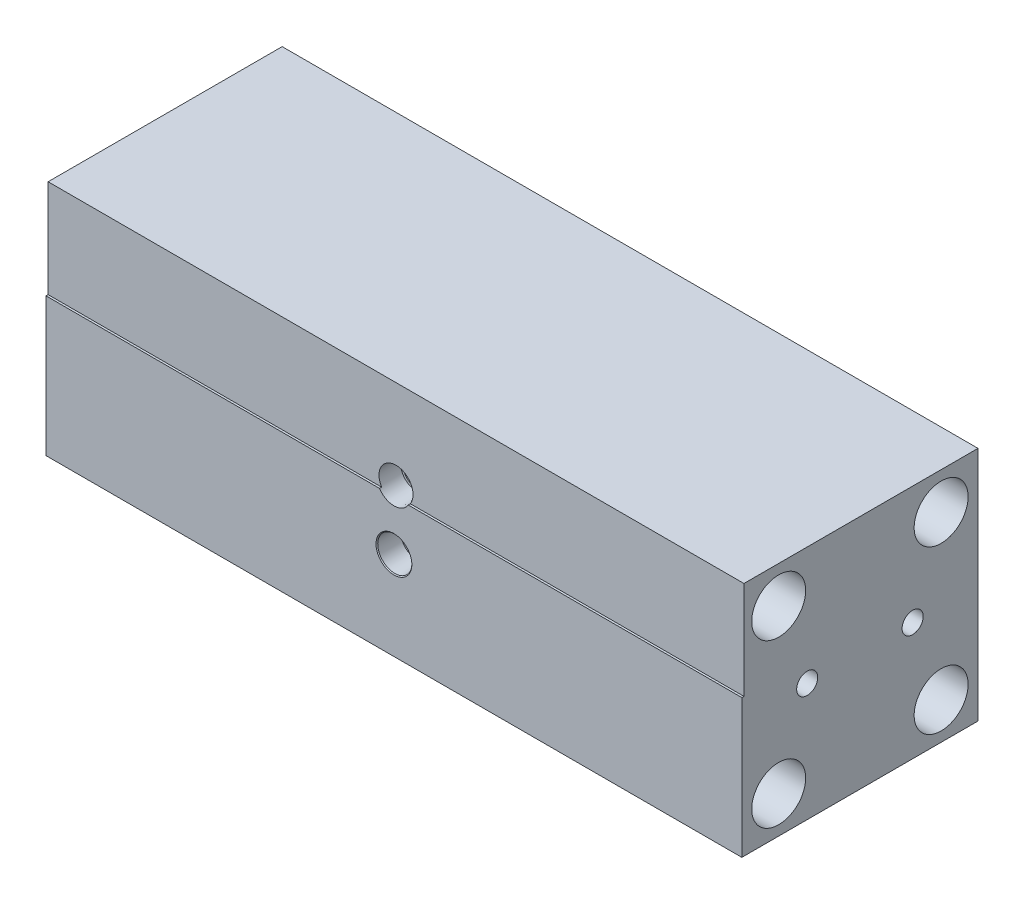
from build123d import *
from OCP.BRepFilletAPI import BRepFilletAPI_MakeChamfer

# Parameters (mm, degrees)
SKETCH1_W                         = 209.55
SKETCH1_H                         = 71.12
EXTRUDE1_DEPTH                    = 35.56
SKETCH18_W                        = 0.635
SKETCH18_H                        = 29.4386
CUT_EXTRUDE1_DEPTH                = 216.4999529
F_1_4_20_TAPPED_HOLE1_D           = 5.1054
F_1_4_20_TAPPED_HOLE1_DEPTH       = 14.3002
F_1_4_20_TAPPED_HOLE1_TIP         = 1.533816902
HOLE1_D                           = 6.35
HOLE1_DEPTH                       = 6.35
HOLE1_TIP                         = 1.907732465
F_1_8_NPT_TAPPED_HOLE1_AT_2_COUNT = 2
F_1_8_NPT_TAPPED_HOLE1_AT_2_PITCH = 17.78
F_1_4_20_TAPPED_HOLE2_D           = 5.1054
F_1_4_20_TAPPED_HOLE2_DEPTH       = 15.875
F_1_4_20_TAPPED_HOLE2_TIP         = 1.533816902
HOLE2_D                           = 6.35
HOLE2_DEPTH                       = 6.35
HOLE2_TIP                         = 1.907732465
SKETCH29_R                        = 8.128
SKETCH29_R_2                      = 3.175
CUT_EXTRUDE2_DEPTH                = 216.4999529
CHAMFER1_SIZE                     = 0.254
CHAMFER1_SIZE2                    = 0.261957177


with BuildPart() as part:
    # Sketch1 → Extrude1 (new, symmetric)
    with BuildSketch(Plane.XY):
        Rectangle(SKETCH1_W, SKETCH1_H)
    extrude(amount=EXTRUDE1_DEPTH, both=True)

    # Sketch18 → Cut-Extrude1 (cut, through all)
    with BuildSketch(Plane(origin=(104.775, 0, 0), x_dir=(0, 0, -1), z_dir=(1, 0, 0))):
        with Locations((-35.2425, 20.8407)):
            Rectangle(SKETCH18_W, SKETCH18_H)
    extrude(amount=-CUT_EXTRUDE1_DEPTH, mode=Mode.SUBTRACT)

    # 1_4-20 Tapped Hole1
    with Locations(Plane(origin=(0.538859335, -35.56, 6.981360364), x_dir=(1, 0, 0), z_dir=(0, -1, 0))):
        with Locations((-64.038859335, -6.981360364), (62.961140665, -6.981360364), (-38.638859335, -6.981360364), (37.561140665, -6.981360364), (-25.938859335, -6.981360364), (24.861140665, -6.981360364)):
            Hole(F_1_4_20_TAPPED_HOLE1_D / 2, depth=F_1_4_20_TAPPED_HOLE1_DEPTH)
            with Locations((0, 0, -(F_1_4_20_TAPPED_HOLE1_DEPTH + F_1_4_20_TAPPED_HOLE1_TIP / 2))):  # 118° drill point
                Cone(0, F_1_4_20_TAPPED_HOLE1_D / 2, F_1_4_20_TAPPED_HOLE1_TIP, mode=Mode.SUBTRACT)

    # Hole1
    with Locations(Plane(origin=(-46.133592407, -35.56, -8.969374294), x_dir=(1, 0, 0), z_dir=(0, -1, 0))):
        with Locations((-4.666407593, 8.969374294), (96.933592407, 8.969374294)):
            Hole(HOLE1_D / 2, depth=HOLE1_DEPTH)
            with Locations((0, 0, -(HOLE1_DEPTH + HOLE1_TIP / 2))):  # 118° drill point
                Cone(0, HOLE1_D / 2, HOLE1_TIP, mode=Mode.SUBTRACT)

    # Sketch23 → 1_8 NPT Tapped Hole1 (revolve, cut)
    with BuildSketch(Plane(origin=(0, -8.89, 35.56), x_dir=(0, -1, 0), z_dir=(1, 0, 0))):
        Polygon((0, 0), (0, 14.166668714), (4.2164, 11.6332), (4.2164, 6.9342), (4.936185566, 6.9342), (5.1438048, 0), align=None)
    f_1_8_npt_tapped_hole1 = revolve(axis=Axis((0, -8.89, 41.91), (0, 0, -1)), mode=Mode.SUBTRACT)

    # 1_8 NPT Tapped Hole1 at 2: 1_8 NPT Tapped Hole1 ×2
    with Locations(*[(0, i * F_1_8_NPT_TAPPED_HOLE1_AT_2_PITCH, 0) for i in range(1, F_1_8_NPT_TAPPED_HOLE1_AT_2_COUNT)]):
        add(f_1_8_npt_tapped_hole1, mode=Mode.SUBTRACT)

    # 1_4-20 Tapped Hole2
    with Locations(Plane(origin=(0, 0, -35.56), x_dir=(-1, 0, 0), z_dir=(0, 0, -1))):
        with Locations((-76.2, 10.16), (76.2, 10.16), (-76.2, -10.16), (76.2, -10.16)):
            Hole(F_1_4_20_TAPPED_HOLE2_D / 2, depth=F_1_4_20_TAPPED_HOLE2_DEPTH)
            with Locations((0, 0, -(F_1_4_20_TAPPED_HOLE2_DEPTH + F_1_4_20_TAPPED_HOLE2_TIP / 2))):  # 118° drill point
                Cone(0, F_1_4_20_TAPPED_HOLE2_D / 2, F_1_4_20_TAPPED_HOLE2_TIP, mode=Mode.SUBTRACT)

    # Hole2
    with Locations(Plane(origin=(0, 0, -35.56), x_dir=(-1, 0, 0), z_dir=(0, 0, -1))):
        with Locations((63.5, 10.16), (-63.5, -10.16)):
            Hole(HOLE2_D / 2, depth=HOLE2_DEPTH)
            with Locations((0, 0, -(HOLE2_DEPTH + HOLE2_TIP / 2))):  # 118° drill point
                Cone(0, HOLE2_D / 2, HOLE2_TIP, mode=Mode.SUBTRACT)

    # Sketch29 → Cut-Extrude2 (cut, through all)
    with BuildSketch(Plane(origin=(104.775, 0, 0), x_dir=(0, 0, -1), z_dir=(1, 0, 0))):
        with Locations((-24.4602, 24.4602)):
            Circle(SKETCH29_R)
        with Locations((24.4602, 24.4602)):
            Circle(SKETCH29_R)
        with Locations((-24.4602, -24.4602)):
            Circle(SKETCH29_R)
        with Locations((24.4602, -24.4602)):
            Circle(SKETCH29_R)
        with Locations((-15.875, 0)):
            Circle(SKETCH29_R_2)
        with Locations((15.875, 0)):
            Circle(SKETCH29_R_2)
    extrude(amount=-CUT_EXTRUDE2_DEPTH, mode=Mode.SUBTRACT)

    # Chamfer1: one chamfer whose edges measure the first distance from different faces: ONE call of the kernel's chamfer builder (chamfer() names one face for all edges)
    chamfer1_edges_1 = [part.edges().sort_by_distance(p)[0] for p in [
        (-66.675, 10.16, -35.56),
        (27.9527, -35.56, 0),
        (-22.8473, -35.56, 0),
        (40.6527, -35.56, 0),
        (-35.5473, -35.56, 0),
        (66.0527, -35.56, 0),
        (-60.9473, -35.56, 0),
        (53.975, -35.56, 0),
        (-47.625, -35.56, 0),
        (-78.7527, -10.16, -35.56),
        (73.6473, -10.16, -35.56),
        (-78.7527, 10.16, -35.56),
        (73.6473, 10.16, -35.56),
        (60.325, -10.16, -35.56),
    ]]
    chamfer1_edges_2 = [part.edges().sort_by_distance(p)[0] for p in [
        (0, -3.7461952, 35.56),
    ]]
    chamfer1_side_2 = [part.faces().sort_by_distance(p)[0] for p in [
        (0, -14.808809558, 35.56),
    ]]
    chamfer1 = BRepFilletAPI_MakeChamfer(part.part.solid().wrapped)
    for e in chamfer1_edges_1:
        chamfer1.Add(CHAMFER1_SIZE, e.wrapped)
    for e in chamfer1_edges_2:
        chamfer1.Add(CHAMFER1_SIZE, CHAMFER1_SIZE2, e.wrapped, chamfer1_side_2[0].wrapped)  # the first distance lies on this face
    add(Compound.cast(chamfer1.Shape()), mode=Mode.REPLACE)


solid = part.part
